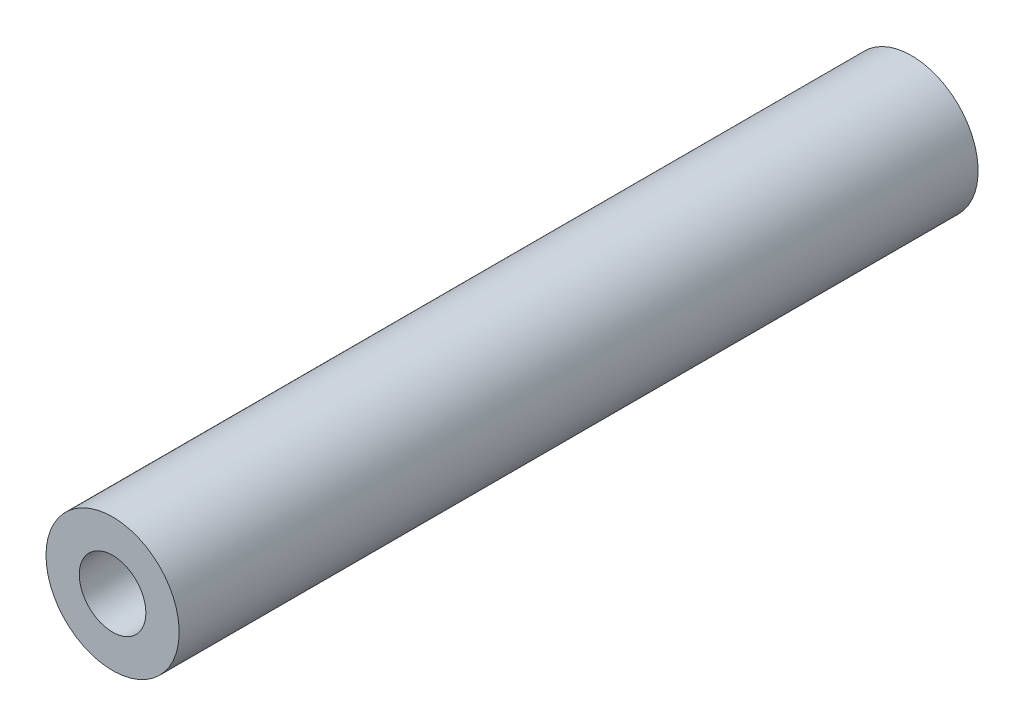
ISO-10303-21;
HEADER;
FILE_DESCRIPTION(('STEP AP214'),'2;1');
FILE_NAME('part.step','',(''),(''),'','','');
FILE_SCHEMA(('AUTOMOTIVE_DESIGN { 1 0 10303 214 1 1 1 1 }'));
ENDSEC;
DATA;
#1=APPLICATION_CONTEXT('core data for automotive mechanical design processes');
#2=APPLICATION_PROTOCOL_DEFINITION('international standard','automotive_design',2000,#1);
#3=PRODUCT_CONTEXT('',#1,'mechanical');
#4=PRODUCT('Part','Part','',(#3));
#5=PRODUCT_RELATED_PRODUCT_CATEGORY('part','',(#4));
#6=PRODUCT_DEFINITION_FORMATION('','',#4);
#7=PRODUCT_DEFINITION_CONTEXT('part definition',#1,'design');
#8=PRODUCT_DEFINITION('design','',#6,#7);
#9=PRODUCT_DEFINITION_SHAPE('','',#8);
#10=(LENGTH_UNIT() NAMED_UNIT(*) SI_UNIT(.MILLI.,.METRE.));
#11=(NAMED_UNIT(*) PLANE_ANGLE_UNIT() SI_UNIT($,.RADIAN.));
#12=(NAMED_UNIT(*) SI_UNIT($,.STERADIAN.) SOLID_ANGLE_UNIT());
#13=UNCERTAINTY_MEASURE_WITH_UNIT(LENGTH_MEASURE(1.E-05),#10,'distance_accuracy_value','');
#14=(GEOMETRIC_REPRESENTATION_CONTEXT(3) GLOBAL_UNCERTAINTY_ASSIGNED_CONTEXT((#13)) GLOBAL_UNIT_ASSIGNED_CONTEXT((#10,
#11,#12)) REPRESENTATION_CONTEXT('',''));
#15=CARTESIAN_POINT('',(0.,0.,0.));
#16=DIRECTION('',(0.,0.,1.));
#17=DIRECTION('',(1.,0.,0.));
#18=AXIS2_PLACEMENT_3D('',#15,#16,#17);
#19=CARTESIAN_POINT('',(0.,0.,38.1));
#20=DIRECTION('',(0.,0.,-1.));
#21=DIRECTION('',(-1.,0.,0.));
#22=AXIS2_PLACEMENT_3D('',#19,#20,#21);
#23=CYLINDRICAL_SURFACE('',#22,3.175);
#24=CARTESIAN_POINT('',(0.,0.,38.1));
#25=DIRECTION('',(0.,0.,1.));
#26=DIRECTION('',(1.,0.,0.));
#27=AXIS2_PLACEMENT_3D('',#24,#25,#26);
#28=CIRCLE('',#27,3.175);
#29=CARTESIAN_POINT('',(-3.175,0.,38.1));
#30=VERTEX_POINT('',#29);
#31=EDGE_CURVE('E10',#30,#30,#28,.T.);
#32=CARTESIAN_POINT('',(0.,0.,0.));
#33=DIRECTION('',(0.,0.,1.));
#34=DIRECTION('',(1.,0.,0.));
#35=AXIS2_PLACEMENT_3D('',#32,#33,#34);
#36=CIRCLE('',#35,3.175);
#37=CARTESIAN_POINT('',(-3.175,0.,0.));
#38=VERTEX_POINT('',#37);
#39=EDGE_CURVE('E34',#38,#38,#36,.T.);
#40=CARTESIAN_POINT('',(-3.175,0.,38.1));
#41=CARTESIAN_POINT('',(-3.175,0.,37.703125));
#42=CARTESIAN_POINT('',(-3.175,0.,37.30625));
#43=CARTESIAN_POINT('',(-3.175,0.,36.5125));
#44=CARTESIAN_POINT('',(-3.175,0.,36.115625));
#45=CARTESIAN_POINT('',(-3.175,0.,35.321875));
#46=CARTESIAN_POINT('',(-3.175,0.,34.925));
#47=CARTESIAN_POINT('',(-3.175,0.,34.13125));
#48=CARTESIAN_POINT('',(-3.175,0.,33.734375));
#49=CARTESIAN_POINT('',(-3.175,0.,32.940625));
#50=CARTESIAN_POINT('',(-3.175,0.,32.54375));
#51=CARTESIAN_POINT('',(-3.175,0.,31.75));
#52=CARTESIAN_POINT('',(-3.175,0.,31.353125));
#53=CARTESIAN_POINT('',(-3.175,0.,30.559375));
#54=CARTESIAN_POINT('',(-3.175,0.,30.1625));
#55=CARTESIAN_POINT('',(-3.175,0.,29.36875));
#56=CARTESIAN_POINT('',(-3.175,0.,28.971875));
#57=CARTESIAN_POINT('',(-3.175,0.,28.178125));
#58=CARTESIAN_POINT('',(-3.175,0.,27.78125));
#59=CARTESIAN_POINT('',(-3.175,0.,26.9875));
#60=CARTESIAN_POINT('',(-3.175,0.,26.590625));
#61=CARTESIAN_POINT('',(-3.175,0.,25.796875));
#62=CARTESIAN_POINT('',(-3.175,0.,25.4));
#63=CARTESIAN_POINT('',(-3.175,0.,24.60625));
#64=CARTESIAN_POINT('',(-3.175,0.,24.209375));
#65=CARTESIAN_POINT('',(-3.175,0.,23.415625));
#66=CARTESIAN_POINT('',(-3.175,0.,23.01875));
#67=CARTESIAN_POINT('',(-3.175,0.,22.225));
#68=CARTESIAN_POINT('',(-3.175,0.,21.828125));
#69=CARTESIAN_POINT('',(-3.175,0.,21.034375));
#70=CARTESIAN_POINT('',(-3.175,0.,20.6375));
#71=CARTESIAN_POINT('',(-3.175,0.,19.84375));
#72=CARTESIAN_POINT('',(-3.175,0.,19.446875));
#73=CARTESIAN_POINT('',(-3.175,0.,18.653125));
#74=CARTESIAN_POINT('',(-3.175,0.,18.25625));
#75=CARTESIAN_POINT('',(-3.175,0.,17.4625));
#76=CARTESIAN_POINT('',(-3.175,0.,17.065625));
#77=CARTESIAN_POINT('',(-3.175,0.,16.271875));
#78=CARTESIAN_POINT('',(-3.175,0.,15.875));
#79=CARTESIAN_POINT('',(-3.175,0.,15.08125));
#80=CARTESIAN_POINT('',(-3.175,0.,14.684375));
#81=CARTESIAN_POINT('',(-3.175,0.,13.890625));
#82=CARTESIAN_POINT('',(-3.175,0.,13.49375));
#83=CARTESIAN_POINT('',(-3.175,0.,12.7));
#84=CARTESIAN_POINT('',(-3.175,0.,12.303125));
#85=CARTESIAN_POINT('',(-3.175,0.,11.509375));
#86=CARTESIAN_POINT('',(-3.175,0.,11.1125));
#87=CARTESIAN_POINT('',(-3.175,0.,10.31875));
#88=CARTESIAN_POINT('',(-3.175,0.,9.921875));
#89=CARTESIAN_POINT('',(-3.175,0.,9.128125));
#90=CARTESIAN_POINT('',(-3.175,0.,8.73125));
#91=CARTESIAN_POINT('',(-3.175,0.,7.9375));
#92=CARTESIAN_POINT('',(-3.175,0.,7.540625));
#93=CARTESIAN_POINT('',(-3.175,0.,6.746875));
#94=CARTESIAN_POINT('',(-3.175,0.,6.35));
#95=CARTESIAN_POINT('',(-3.175,0.,5.55625));
#96=CARTESIAN_POINT('',(-3.175,0.,5.159375));
#97=CARTESIAN_POINT('',(-3.175,0.,4.365625));
#98=CARTESIAN_POINT('',(-3.175,0.,3.96875));
#99=CARTESIAN_POINT('',(-3.175,0.,3.175));
#100=CARTESIAN_POINT('',(-3.175,0.,2.778125));
#101=CARTESIAN_POINT('',(-3.175,0.,1.984375));
#102=CARTESIAN_POINT('',(-3.175,0.,1.5875));
#103=CARTESIAN_POINT('',(-3.175,0.,0.79375));
#104=CARTESIAN_POINT('',(-3.175,0.,0.396875));
#105=CARTESIAN_POINT('',(-3.175,0.,0.));
#106=B_SPLINE_CURVE_WITH_KNOTS('',3,(#40,#41,#42,#43,#44,#45,#46,#47,#48,#49,#50,#51,#52,#53,
#54,#55,#56,#57,#58,#59,#60,#61,#62,#63,#64,#65,#66,#67,#68,#69,#70,#71,#72,#73,#74,#75,#76,#77,
#78,#79,#80,#81,#82,#83,#84,#85,#86,#87,#88,#89,#90,#91,#92,#93,#94,#95,#96,#97,#98,#99,#100,
#101,#102,#103,#104,#105),.UNSPECIFIED.,.F.,.F.,(4,2,2,2,2,2,2,2,2,2,2,2,2,2,2,2,2,2,2,2,2,2,2,
2,2,2,2,2,2,2,2,2,4),(0.,1.19062499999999,2.38124999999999,3.571875,4.7625,5.953125,7.14375,
8.33437499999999,9.525,10.715625,11.90625,13.096875,14.2875,15.478125,16.66875,17.859375,19.05,
20.240625,21.43125,22.621875,23.8125,25.003125,26.19375,27.384375,28.575,29.765625,30.95625,
32.146875,33.3375,34.528125,35.71875,36.909375,38.1),.UNSPECIFIED.);
#107=EDGE_CURVE('BSEAM31',#30,#38,#106,.T.);
#108=ORIENTED_EDGE('',*,*,#31,.F.);
#109=ORIENTED_EDGE('',*,*,#39,.T.);
#110=ORIENTED_EDGE('',*,*,#107,.T.);
#111=ORIENTED_EDGE('',*,*,#107,.F.);
#112=EDGE_LOOP('',(#108,#110,#109,#111));
#113=FACE_BOUND('',#112,.T.);
#114=ADVANCED_FACE('F31',(#113),#23,.T.);
#115=CARTESIAN_POINT('',(0.,0.,38.1));
#116=DIRECTION('',(0.,0.,1.));
#117=DIRECTION('',(1.,0.,0.));
#118=AXIS2_PLACEMENT_3D('',#115,#116,#117);
#119=PLANE('',#118);
#120=CARTESIAN_POINT('',(0.,0.,38.1));
#121=DIRECTION('',(0.,0.,1.));
#122=DIRECTION('',(1.,0.,0.));
#123=AXIS2_PLACEMENT_3D('',#120,#121,#122);
#124=CIRCLE('',#123,1.5875);
#125=CARTESIAN_POINT('',(1.5875,0.,38.1));
#126=VERTEX_POINT('',#125);
#127=EDGE_CURVE('E43',#126,#126,#124,.T.);
#128=ORIENTED_EDGE('',*,*,#127,.F.);
#129=EDGE_LOOP('',(#128));
#130=FACE_BOUND('',#129,.T.);
#131=ORIENTED_EDGE('',*,*,#31,.T.);
#132=EDGE_LOOP('',(#131));
#133=FACE_BOUND('',#132,.T.);
#134=ADVANCED_FACE('F58',(#130,#133),#119,.T.);
#135=CARTESIAN_POINT('',(0.,0.,0.));
#136=DIRECTION('',(0.,0.,1.));
#137=DIRECTION('',(1.,0.,0.));
#138=AXIS2_PLACEMENT_3D('',#135,#136,#137);
#139=PLANE('',#138);
#140=CARTESIAN_POINT('',(0.,0.,0.));
#141=DIRECTION('',(0.,0.,1.));
#142=DIRECTION('',(1.,0.,0.));
#143=AXIS2_PLACEMENT_3D('',#140,#141,#142);
#144=CIRCLE('',#143,1.5875);
#145=CARTESIAN_POINT('',(1.5875,0.,0.));
#146=VERTEX_POINT('',#145);
#147=EDGE_CURVE('E41',#146,#146,#144,.T.);
#148=ORIENTED_EDGE('',*,*,#147,.T.);
#149=EDGE_LOOP('',(#148));
#150=FACE_BOUND('',#149,.T.);
#151=ORIENTED_EDGE('',*,*,#39,.F.);
#152=EDGE_LOOP('',(#151));
#153=FACE_BOUND('',#152,.T.);
#154=ADVANCED_FACE('F49',(#150,#153),#139,.F.);
#155=CARTESIAN_POINT('',(0.,0.,0.));
#156=DIRECTION('',(0.,0.,1.));
#157=DIRECTION('',(1.,0.,0.));
#158=AXIS2_PLACEMENT_3D('',#155,#156,#157);
#159=CYLINDRICAL_SURFACE('',#158,1.5875);
#160=CARTESIAN_POINT('',(1.5875,0.,0.));
#161=CARTESIAN_POINT('',(1.5875,0.,0.396875));
#162=CARTESIAN_POINT('',(1.5875,0.,0.79375));
#163=CARTESIAN_POINT('',(1.5875,0.,1.5875));
#164=CARTESIAN_POINT('',(1.5875,0.,1.984375));
#165=CARTESIAN_POINT('',(1.5875,0.,2.778125));
#166=CARTESIAN_POINT('',(1.5875,0.,3.175));
#167=CARTESIAN_POINT('',(1.5875,0.,3.96875));
#168=CARTESIAN_POINT('',(1.5875,0.,4.365625));
#169=CARTESIAN_POINT('',(1.5875,0.,5.159375));
#170=CARTESIAN_POINT('',(1.5875,0.,5.55625));
#171=CARTESIAN_POINT('',(1.5875,0.,6.35));
#172=CARTESIAN_POINT('',(1.5875,0.,6.746875));
#173=CARTESIAN_POINT('',(1.5875,0.,7.540625));
#174=CARTESIAN_POINT('',(1.5875,0.,7.9375));
#175=CARTESIAN_POINT('',(1.5875,0.,8.73125));
#176=CARTESIAN_POINT('',(1.5875,0.,9.128125));
#177=CARTESIAN_POINT('',(1.5875,0.,9.921875));
#178=CARTESIAN_POINT('',(1.5875,0.,10.31875));
#179=CARTESIAN_POINT('',(1.5875,0.,11.1125));
#180=CARTESIAN_POINT('',(1.5875,0.,11.509375));
#181=CARTESIAN_POINT('',(1.5875,0.,12.303125));
#182=CARTESIAN_POINT('',(1.5875,0.,12.7));
#183=CARTESIAN_POINT('',(1.5875,0.,13.49375));
#184=CARTESIAN_POINT('',(1.5875,0.,13.890625));
#185=CARTESIAN_POINT('',(1.5875,0.,14.684375));
#186=CARTESIAN_POINT('',(1.5875,0.,15.08125));
#187=CARTESIAN_POINT('',(1.5875,0.,15.875));
#188=CARTESIAN_POINT('',(1.5875,0.,16.271875));
#189=CARTESIAN_POINT('',(1.5875,0.,17.065625));
#190=CARTESIAN_POINT('',(1.5875,0.,17.4625));
#191=CARTESIAN_POINT('',(1.5875,0.,18.25625));
#192=CARTESIAN_POINT('',(1.5875,0.,18.653125));
#193=CARTESIAN_POINT('',(1.5875,0.,19.446875));
#194=CARTESIAN_POINT('',(1.5875,0.,19.84375));
#195=CARTESIAN_POINT('',(1.5875,0.,20.6375));
#196=CARTESIAN_POINT('',(1.5875,0.,21.034375));
#197=CARTESIAN_POINT('',(1.5875,0.,21.828125));
#198=CARTESIAN_POINT('',(1.5875,0.,22.225));
#199=CARTESIAN_POINT('',(1.5875,0.,23.01875));
#200=CARTESIAN_POINT('',(1.5875,0.,23.415625));
#201=CARTESIAN_POINT('',(1.5875,0.,24.209375));
#202=CARTESIAN_POINT('',(1.5875,0.,24.60625));
#203=CARTESIAN_POINT('',(1.5875,0.,25.4));
#204=CARTESIAN_POINT('',(1.5875,0.,25.796875));
#205=CARTESIAN_POINT('',(1.5875,0.,26.590625));
#206=CARTESIAN_POINT('',(1.5875,0.,26.9875));
#207=CARTESIAN_POINT('',(1.5875,0.,27.78125));
#208=CARTESIAN_POINT('',(1.5875,0.,28.178125));
#209=CARTESIAN_POINT('',(1.5875,0.,28.971875));
#210=CARTESIAN_POINT('',(1.5875,0.,29.36875));
#211=CARTESIAN_POINT('',(1.5875,0.,30.1625));
#212=CARTESIAN_POINT('',(1.5875,0.,30.559375));
#213=CARTESIAN_POINT('',(1.5875,0.,31.353125));
#214=CARTESIAN_POINT('',(1.5875,0.,31.75));
#215=CARTESIAN_POINT('',(1.5875,0.,32.54375));
#216=CARTESIAN_POINT('',(1.5875,0.,32.940625));
#217=CARTESIAN_POINT('',(1.5875,0.,33.734375));
#218=CARTESIAN_POINT('',(1.5875,0.,34.13125));
#219=CARTESIAN_POINT('',(1.5875,0.,34.925));
#220=CARTESIAN_POINT('',(1.5875,0.,35.321875));
#221=CARTESIAN_POINT('',(1.5875,0.,36.115625));
#222=CARTESIAN_POINT('',(1.5875,0.,36.5125));
#223=CARTESIAN_POINT('',(1.5875,0.,37.30625));
#224=CARTESIAN_POINT('',(1.5875,0.,37.703125));
#225=CARTESIAN_POINT('',(1.5875,0.,38.1));
#226=B_SPLINE_CURVE_WITH_KNOTS('',3,(#160,#161,#162,#163,#164,#165,#166,#167,#168,#169,#170,
#171,#172,#173,#174,#175,#176,#177,#178,#179,#180,#181,#182,#183,#184,#185,#186,#187,#188,#189,
#190,#191,#192,#193,#194,#195,#196,#197,#198,#199,#200,#201,#202,#203,#204,#205,#206,#207,#208,
#209,#210,#211,#212,#213,#214,#215,#216,#217,#218,#219,#220,#221,#222,#223,#224,#225),
.UNSPECIFIED.,.F.,.F.,(4,2,2,2,2,2,2,2,2,2,2,2,2,2,2,2,2,2,2,2,2,2,2,2,2,2,2,2,2,2,2,2,4),(0.,
1.190625,2.38125,3.571875,4.7625,5.953125,7.14375,8.334375,9.525,10.715625,11.90625,13.096875,
14.2875,15.478125,16.66875,17.859375,19.05,20.240625,21.43125,22.621875,23.8125,25.003125,
26.19375,27.384375,28.575,29.765625,30.95625,32.146875,33.3375,34.528125,35.71875,36.909375,
38.1),.UNSPECIFIED.);
#227=EDGE_CURVE('BSEAM52',#146,#126,#226,.T.);
#228=ORIENTED_EDGE('',*,*,#147,.F.);
#229=ORIENTED_EDGE('',*,*,#127,.T.);
#230=ORIENTED_EDGE('',*,*,#227,.T.);
#231=ORIENTED_EDGE('',*,*,#227,.F.);
#232=EDGE_LOOP('',(#228,#230,#229,#231));
#233=FACE_BOUND('',#232,.T.);
#234=ADVANCED_FACE('F52',(#233),#159,.F.);
#235=CLOSED_SHELL('',(#114,#134,#154,#234));
#236=MANIFOLD_SOLID_BREP('B2',#235);
#237=ADVANCED_BREP_SHAPE_REPRESENTATION('',(#18,#236),#14);
#238=SHAPE_DEFINITION_REPRESENTATION(#9,#237);
ENDSEC;
END-ISO-10303-21;
